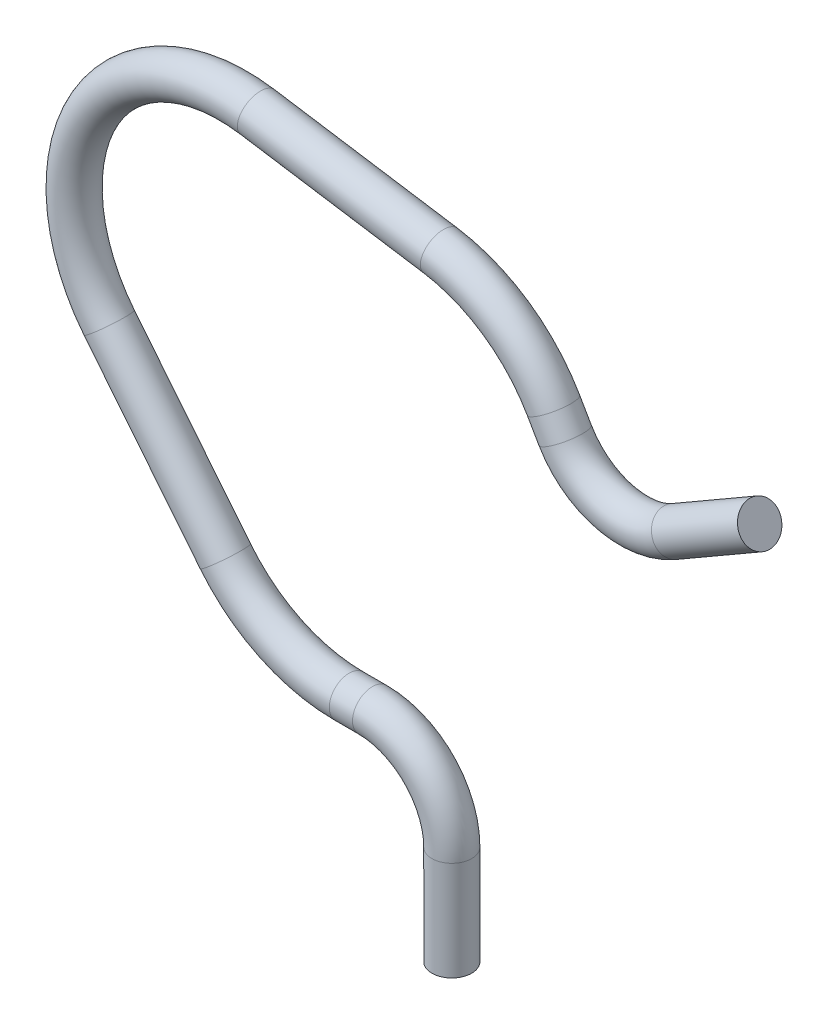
from build123d import *

# Parameters (mm, degrees)
ESQUISSE2_R = 0.5


with BuildPart() as part:
    # Base-Balayage: sweep along a path in Esquisse1
    with BuildLine(Plane.XY) as base_balayage_path:
        Line((0, 0), (0, 2.5))
        ThreePointArc((0, 2.5), (-0.585786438, 3.914213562), (-2, 4.5))
        Line((-2, 4.5), (-2.58566501, 4.5))
        ThreePointArc((-2.58566501, 4.5), (-4.312435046, 4.89191668), (-5.700830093, 5.990867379))
        Line((-5.700830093, 5.990867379), (-8.624378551, 9.620542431))
        ThreePointArc((-8.624378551, 9.620542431), (-8.973315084, 14.129675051), (-4.893823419, 16.08205346))
        Line((-4.893823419, 16.08205346), (-0.288658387, 15.365023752))
        ThreePointArc((-0.288658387, 15.365023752), (1.357258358, 14.712113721), (2.560053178, 13.412645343))
        Line((2.560053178, 13.412645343), (2.852885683, 12.905444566))
        ThreePointArc((2.852885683, 12.905444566), (4.0672984, 11.973592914), (5.584936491, 12.173393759))
        Line((5.584936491, 12.173393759), (7.75, 13.423393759))
    # Esquisse2 → Base-Balayage (sweep)
    with BuildSketch(Plane(origin=(0, 0, 0), x_dir=(1, 0, 0), z_dir=(0, 1, 0))):
        Circle(ESQUISSE2_R)
    sweep(path=base_balayage_path.line)


solid = part.part
